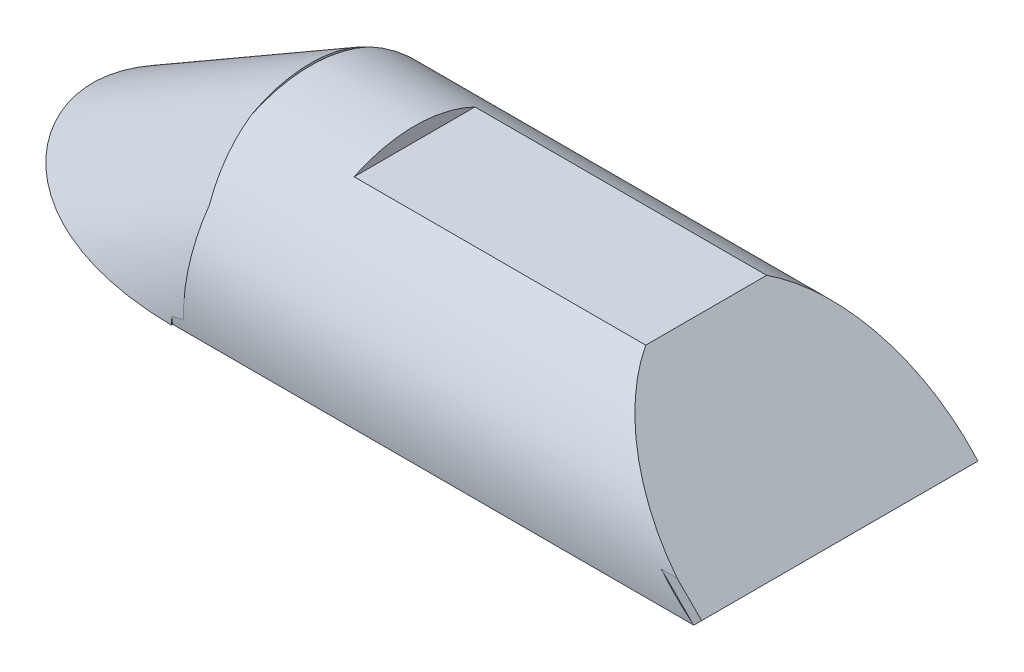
ISO-10303-21;
HEADER;
FILE_DESCRIPTION(('STEP AP214'),'2;1');
FILE_NAME('part.step','',(''),(''),'','','');
FILE_SCHEMA(('AUTOMOTIVE_DESIGN { 1 0 10303 214 1 1 1 1 }'));
ENDSEC;
DATA;
#1=APPLICATION_CONTEXT('core data for automotive mechanical design processes');
#2=APPLICATION_PROTOCOL_DEFINITION('international standard','automotive_design',2000,#1);
#3=PRODUCT_CONTEXT('',#1,'mechanical');
#4=PRODUCT('Part','Part','',(#3));
#5=PRODUCT_RELATED_PRODUCT_CATEGORY('part','',(#4));
#6=PRODUCT_DEFINITION_FORMATION('','',#4);
#7=PRODUCT_DEFINITION_CONTEXT('part definition',#1,'design');
#8=PRODUCT_DEFINITION('design','',#6,#7);
#9=PRODUCT_DEFINITION_SHAPE('','',#8);
#10=(LENGTH_UNIT() NAMED_UNIT(*) SI_UNIT(.MILLI.,.METRE.));
#11=(NAMED_UNIT(*) PLANE_ANGLE_UNIT() SI_UNIT($,.RADIAN.));
#12=(NAMED_UNIT(*) SI_UNIT($,.STERADIAN.) SOLID_ANGLE_UNIT());
#13=UNCERTAINTY_MEASURE_WITH_UNIT(LENGTH_MEASURE(1.E-05),#10,'distance_accuracy_value','');
#14=(GEOMETRIC_REPRESENTATION_CONTEXT(3) GLOBAL_UNCERTAINTY_ASSIGNED_CONTEXT((#13)) GLOBAL_UNIT_ASSIGNED_CONTEXT((#10,
#11,#12)) REPRESENTATION_CONTEXT('',''));
#15=CARTESIAN_POINT('',(0.,0.,0.));
#16=DIRECTION('',(0.,0.,1.));
#17=DIRECTION('',(1.,0.,0.));
#18=AXIS2_PLACEMENT_3D('',#15,#16,#17);
#19=CARTESIAN_POINT('',(102.697086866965,1.77800000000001,0.));
#20=DIRECTION('',(-1.,0.,0.));
#21=DIRECTION('',(0.,-1.,0.));
#22=AXIS2_PLACEMENT_3D('',#19,#20,#21);
#23=CYLINDRICAL_SURFACE('',#22,12.7);
#24=DIRECTION('',(-1.,0.,0.));
#25=VECTOR('',#24,1.);
#26=CARTESIAN_POINT('',(102.697086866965,13.2097724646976,-5.53214048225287));
#27=LINE('',#26,#25);
#28=CARTESIAN_POINT('',(36.2235974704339,13.2097724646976,-5.53214048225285));
#29=VERTEX_POINT('',#28);
#30=CARTESIAN_POINT('',(9.53447934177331,13.2097724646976,-5.53214048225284));
#31=VERTEX_POINT('',#30);
#32=EDGE_CURVE('E139',#29,#31,#27,.T.);
#33=ORIENTED_EDGE('',*,*,#32,.F.);
#34=CARTESIAN_POINT('',(47.6553699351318,1.77800000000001,0.));
#35=DIRECTION('',(0.707106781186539,0.707106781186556,0.));
#36=DIRECTION('',(-0.707106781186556,0.707106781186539,0.));
#37=AXIS2_PLACEMENT_3D('',#34,#35,#36);
#38=ELLIPSE('',#37,17.9605122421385,12.7);
#39=CARTESIAN_POINT('',(48.4191965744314,1.01417336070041,-12.6770094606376));
#40=VERTEX_POINT('',#39);
#41=EDGE_CURVE('E254',#29,#40,#38,.F.);
#42=ORIENTED_EDGE('',*,*,#41,.T.);
#43=CARTESIAN_POINT('',(49.183023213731,1.77800000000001,0.));
#44=DIRECTION('',(-0.707106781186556,0.707106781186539,0.));
#45=DIRECTION('',(-0.707106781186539,-0.707106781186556,0.));
#46=AXIS2_PLACEMENT_3D('',#43,#44,#45);
#47=ELLIPSE('',#46,17.9605122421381,12.7);
#48=CARTESIAN_POINT('',(47.7007760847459,0.295752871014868,-12.6132051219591));
#49=VERTEX_POINT('',#48);
#50=EDGE_CURVE('E159',#49,#40,#47,.F.);
#51=ORIENTED_EDGE('',*,*,#50,.F.);
#52=DIRECTION('',(1.,0.,0.));
#53=VECTOR('',#52,1.);
#54=CARTESIAN_POINT('',(38.6485434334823,0.295752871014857,-12.6132051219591));
#55=LINE('',#54,#53);
#56=CARTESIAN_POINT('',(0.,0.29575287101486,-12.6132051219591));
#57=VERTEX_POINT('',#56);
#58=EDGE_CURVE('E223',#49,#57,#55,.F.);
#59=ORIENTED_EDGE('',*,*,#58,.T.);
#60=CARTESIAN_POINT('',(0.,1.77800000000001,0.));
#61=DIRECTION('',(1.,0.,0.));
#62=DIRECTION('',(0.,0.,-1.));
#63=AXIS2_PLACEMENT_3D('',#60,#61,#62);
#64=CIRCLE('',#63,12.7);
#65=CARTESIAN_POINT('',(0.,0.952827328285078,-12.6731641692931));
#66=VERTEX_POINT('',#65);
#67=EDGE_CURVE('E145',#57,#66,#64,.T.);
#68=ORIENTED_EDGE('',*,*,#67,.T.);
#69=CARTESIAN_POINT('',(3.07958633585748,1.77800000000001,0.));
#70=DIRECTION('',(0.25881904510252,-0.965925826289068,0.));
#71=DIRECTION('',(-0.965925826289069,-0.25881904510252,0.));
#72=AXIS2_PLACEMENT_3D('',#69,#70,#71);
#73=ELLIPSE('',#72,49.0690319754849,12.7);
#74=CARTESIAN_POINT('',(1.09708686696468,1.2467908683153,-12.6888855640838));
#75=VERTEX_POINT('',#74);
#76=EDGE_CURVE('E164',#66,#75,#73,.T.);
#77=ORIENTED_EDGE('',*,*,#76,.T.);
#78=CARTESIAN_POINT('',(1.09708686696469,1.778,0.));
#79=DIRECTION('',(1.,0.,0.));
#80=DIRECTION('',(0.,1.,0.));
#81=AXIS2_PLACEMENT_3D('',#78,#79,#80);
#82=CIRCLE('',#81,12.7);
#83=CARTESIAN_POINT('',(1.09708686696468,9.176788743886,-10.3222054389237));
#84=VERTEX_POINT('',#83);
#85=EDGE_CURVE('E229',#75,#84,#82,.T.);
#86=ORIENTED_EDGE('',*,*,#85,.T.);
#87=CARTESIAN_POINT('',(3.07958633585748,1.77800000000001,0.));
#88=DIRECTION('',(-0.965925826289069,-0.25881904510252,0.));
#89=DIRECTION('',(0.25881904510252,-0.965925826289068,0.));
#90=AXIS2_PLACEMENT_3D('',#87,#88,#89);
#91=ELLIPSE('',#90,13.1480074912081,12.7);
#92=CARTESIAN_POINT('',(0.,13.2711726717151,-5.40342316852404));
#93=VERTEX_POINT('',#92);
#94=EDGE_CURVE('E165',#84,#93,#91,.F.);
#95=ORIENTED_EDGE('',*,*,#94,.T.);
#96=CARTESIAN_POINT('',(0.,13.2711726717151,5.40342316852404));
#97=VERTEX_POINT('',#96);
#98=EDGE_CURVE('E57',#93,#97,#64,.T.);
#99=ORIENTED_EDGE('',*,*,#98,.T.);
#100=CARTESIAN_POINT('',(1.09708686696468,9.17678874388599,10.3222054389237));
#101=VERTEX_POINT('',#100);
#102=EDGE_CURVE('E162',#97,#101,#91,.F.);
#103=ORIENTED_EDGE('',*,*,#102,.T.);
#104=CARTESIAN_POINT('',(1.09708686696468,1.24679086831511,12.6888855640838));
#105=VERTEX_POINT('',#104);
#106=EDGE_CURVE('E231',#101,#105,#82,.T.);
#107=ORIENTED_EDGE('',*,*,#106,.T.);
#108=CARTESIAN_POINT('',(0.,0.952827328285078,12.6731641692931));
#109=VERTEX_POINT('',#108);
#110=EDGE_CURVE('E167',#105,#109,#73,.T.);
#111=ORIENTED_EDGE('',*,*,#110,.T.);
#112=CARTESIAN_POINT('',(0.,0.295752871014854,12.6132051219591));
#113=VERTEX_POINT('',#112);
#114=EDGE_CURVE('E157',#109,#113,#64,.T.);
#115=ORIENTED_EDGE('',*,*,#114,.T.);
#116=DIRECTION('',(1.,0.,0.));
#117=VECTOR('',#116,1.);
#118=CARTESIAN_POINT('',(38.6485434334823,0.295752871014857,12.6132051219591));
#119=LINE('',#118,#117);
#120=CARTESIAN_POINT('',(47.7007760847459,0.295752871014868,12.6132051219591));
#121=VERTEX_POINT('',#120);
#122=EDGE_CURVE('E222',#113,#121,#119,.T.);
#123=ORIENTED_EDGE('',*,*,#122,.T.);
#124=CARTESIAN_POINT('',(46.2185289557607,1.77800000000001,0.));
#125=DIRECTION('',(-0.707106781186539,-0.707106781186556,0.));
#126=DIRECTION('',(-0.707106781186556,0.707106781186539,0.));
#127=AXIS2_PLACEMENT_3D('',#124,#125,#126);
#128=ELLIPSE('',#127,17.9605122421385,12.7);
#129=CARTESIAN_POINT('',(44.7362818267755,3.26024712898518,12.6132051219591));
#130=VERTEX_POINT('',#129);
#131=EDGE_CURVE('E186',#121,#130,#128,.T.);
#132=ORIENTED_EDGE('',*,*,#131,.T.);
#133=DIRECTION('',(-1.,0.,0.));
#134=VECTOR('',#133,1.);
#135=CARTESIAN_POINT('',(48.4191965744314,3.26024712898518,12.6132051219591));
#136=LINE('',#135,#134);
#137=CARTESIAN_POINT('',(46.1731228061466,3.26024712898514,12.6132051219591));
#138=VERTEX_POINT('',#137);
#139=EDGE_CURVE('E156',#138,#130,#136,.T.);
#140=ORIENTED_EDGE('',*,*,#139,.F.);
#141=CARTESIAN_POINT('',(36.2235974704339,13.2097724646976,5.53214048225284));
#142=VERTEX_POINT('',#141);
#143=EDGE_CURVE('E152',#138,#142,#38,.F.);
#144=ORIENTED_EDGE('',*,*,#143,.T.);
#145=DIRECTION('',(-1.,0.,0.));
#146=VECTOR('',#145,1.);
#147=CARTESIAN_POINT('',(102.697086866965,13.2097724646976,5.53214048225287));
#148=LINE('',#147,#146);
#149=CARTESIAN_POINT('',(9.54235371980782,13.2097724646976,5.53214048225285));
#150=VERTEX_POINT('',#149);
#151=EDGE_CURVE('E49',#150,#142,#148,.F.);
#152=ORIENTED_EDGE('',*,*,#151,.F.);
#153=CARTESIAN_POINT('',(9.53841653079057,1.778,0.));
#154=DIRECTION('',(0.999999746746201,0.,-0.000711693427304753));
#155=DIRECTION('',(-0.000711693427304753,-1.71909369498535E-13,-0.999999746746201));
#156=AXIS2_PLACEMENT_3D('',#153,#154,#155);
#157=ELLIPSE('',#156,12.7000032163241,12.7);
#158=EDGE_CURVE('E12',#31,#150,#157,.T.);
#159=ORIENTED_EDGE('',*,*,#158,.F.);
#160=EDGE_LOOP('',(#33,#42,#51,#59,#68,#77,#86,#95,#99,#103,#107,#111,#115,#123,#132,#140,#144,
#152,#159));
#161=FACE_BOUND('',#160,.T.);
#162=ADVANCED_FACE('F33',(#161),#23,.T.);
#163=CARTESIAN_POINT('',(48.4191965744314,1.01417336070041,-12.7));
#164=DIRECTION('',(0.707106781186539,0.707106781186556,0.));
#165=DIRECTION('',(-0.707106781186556,0.707106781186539,0.));
#166=AXIS2_PLACEMENT_3D('',#163,#164,#165);
#167=PLANE('',#166);
#168=ORIENTED_EDGE('',*,*,#41,.F.);
#169=DIRECTION('',(0.,0.,1.));
#170=VECTOR('',#169,1.);
#171=CARTESIAN_POINT('',(36.2235974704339,13.2097724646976,-12.7));
#172=LINE('',#171,#170);
#173=EDGE_CURVE('E42',#29,#142,#172,.T.);
#174=ORIENTED_EDGE('',*,*,#173,.T.);
#175=ORIENTED_EDGE('',*,*,#143,.F.);
#176=DIRECTION('',(0.707106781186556,-0.707106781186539,0.));
#177=VECTOR('',#176,1.);
#178=CARTESIAN_POINT('',(48.4191965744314,1.01417336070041,12.6132051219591));
#179=LINE('',#178,#177);
#180=CARTESIAN_POINT('',(48.4191965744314,1.01417336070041,12.6132051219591));
#181=VERTEX_POINT('',#180);
#182=EDGE_CURVE('E179',#138,#181,#179,.T.);
#183=ORIENTED_EDGE('',*,*,#182,.T.);
#184=DIRECTION('',(0.,0.,-1.));
#185=VECTOR('',#184,1.);
#186=CARTESIAN_POINT('',(48.4191965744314,1.01417336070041,12.6132051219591));
#187=LINE('',#186,#185);
#188=EDGE_CURVE('E176',#181,#40,#187,.T.);
#189=ORIENTED_EDGE('',*,*,#188,.T.);
#190=EDGE_LOOP('',(#168,#174,#175,#183,#189));
#191=FACE_BOUND('',#190,.T.);
#192=ADVANCED_FACE('F298',(#191),#167,.T.);
#193=CARTESIAN_POINT('',(42.9770329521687,24.8128015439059,0.));
#194=DIRECTION('',(-0.86602540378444,-0.499999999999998,0.));
#195=DIRECTION('',(0.499999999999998,-0.86602540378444,0.));
#196=AXIS2_PLACEMENT_3D('',#193,#194,#195);
#197=CYLINDRICAL_SURFACE('',#196,12.7);
#198=ORIENTED_EDGE('',*,*,#94,.F.);
#199=CARTESIAN_POINT('',(1.09708686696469,0.63340339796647,0.));
#200=DIRECTION('',(1.,0.,0.));
#201=DIRECTION('',(0.,-1.,0.));
#202=AXIS2_PLACEMENT_3D('',#199,#200,#201);
#203=ELLIPSE('',#202,14.6646968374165,12.7);
#204=EDGE_CURVE('E234',#84,#75,#203,.F.);
#205=ORIENTED_EDGE('',*,*,#204,.T.);
#206=ORIENTED_EDGE('',*,*,#76,.F.);
#207=CARTESIAN_POINT('',(0.,0.,0.));
#208=DIRECTION('',(1.,0.,0.));
#209=DIRECTION('',(0.,-1.,0.));
#210=AXIS2_PLACEMENT_3D('',#207,#208,#209);
#211=ELLIPSE('',#210,14.6646968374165,12.7);
#212=CARTESIAN_POINT('',(0.,0.254729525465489,-12.6980838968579));
#213=VERTEX_POINT('',#212);
#214=EDGE_CURVE('E168',#66,#213,#211,.F.);
#215=ORIENTED_EDGE('',*,*,#214,.T.);
#216=CARTESIAN_POINT('',(2.0488046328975,0.265849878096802,12.67514476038));
#217=CARTESIAN_POINT('',(1.78330650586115,0.261925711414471,12.6832470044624));
#218=CARTESIAN_POINT('',(1.5177391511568,0.258933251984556,12.6894190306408));
#219=CARTESIAN_POINT('',(0.986518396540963,0.254890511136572,12.6977532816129));
#220=CARTESIAN_POINT('',(0.720864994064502,0.253840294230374,12.6999153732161));
#221=CARTESIAN_POINT('',(-0.0763067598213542,0.253721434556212,12.7001621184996));
#222=CARTESIAN_POINT('',(-0.607849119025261,0.257687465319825,12.6920013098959));
#223=CARTESIAN_POINT('',(-1.67468857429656,0.274431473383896,12.6574225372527));
#224=CARTESIAN_POINT('',(-2.20997966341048,0.287283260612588,12.6308516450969));
#225=CARTESIAN_POINT('',(-3.27882513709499,0.322547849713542,12.5574499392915));
#226=CARTESIAN_POINT('',(-3.81237971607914,0.344959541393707,12.5106214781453));
#227=CARTESIAN_POINT('',(-4.88841182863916,0.400605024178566,12.3931792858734));
#228=CARTESIAN_POINT('',(-5.43082312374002,0.434068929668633,12.3220585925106));
#229=CARTESIAN_POINT('',(-6.51086699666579,0.512281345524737,12.1534465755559));
#230=CARTESIAN_POINT('',(-7.04849876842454,0.557031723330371,12.0559508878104));
#231=CARTESIAN_POINT('',(-8.11460301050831,0.658068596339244,11.831629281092));
#232=CARTESIAN_POINT('',(-8.64310090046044,0.714314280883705,11.7049069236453));
#233=CARTESIAN_POINT('',(-9.68945040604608,0.838540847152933,11.4181775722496));
#234=CARTESIAN_POINT('',(-10.2073072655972,0.906515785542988,11.2581874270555));
#235=CARTESIAN_POINT('',(-11.0805090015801,1.03249092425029,10.9524302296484));
#236=CARTESIAN_POINT('',(-11.4395159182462,1.08768535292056,10.8159449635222));
#237=CARTESIAN_POINT('',(-12.1482468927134,1.20344419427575,10.5224036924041));
#238=CARTESIAN_POINT('',(-12.4979697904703,1.26400927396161,10.3653451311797));
#239=CARTESIAN_POINT('',(-13.1846167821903,1.38968158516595,10.029674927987));
#240=CARTESIAN_POINT('',(-13.5215802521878,1.45477271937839,9.85113817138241));
#241=CARTESIAN_POINT('',(-14.18128399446,1.58877320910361,9.47065184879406));
#242=CARTESIAN_POINT('',(-14.5040246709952,1.6576824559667,9.26870294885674));
#243=CARTESIAN_POINT('',(-15.1362740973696,1.79897249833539,8.83743119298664));
#244=CARTESIAN_POINT('',(-15.4455589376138,1.87138657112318,8.60778932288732));
#245=CARTESIAN_POINT('',(-16.0428488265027,2.01715030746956,8.12242386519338));
#246=CARTESIAN_POINT('',(-16.3308523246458,2.09050003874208,7.866698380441));
#247=CARTESIAN_POINT('',(-16.8814166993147,2.23595382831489,7.32926441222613));
#248=CARTESIAN_POINT('',(-17.1440005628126,2.30805896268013,7.04757986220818));
#249=CARTESIAN_POINT('',(-17.6399342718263,2.44862717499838,6.45873707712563));
#250=CARTESIAN_POINT('',(-17.8732948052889,2.51709157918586,6.15158822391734));
#251=CARTESIAN_POINT('',(-18.2505115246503,2.63073977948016,5.59642186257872));
#252=CARTESIAN_POINT('',(-18.401871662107,2.6773514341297,5.35376819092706));
#253=CARTESIAN_POINT('',(-18.6849189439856,2.76602006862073,4.85647201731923));
#254=CARTESIAN_POINT('',(-18.8166101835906,2.80807799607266,4.60183202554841));
#255=CARTESIAN_POINT('',(-19.0589285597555,2.88657385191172,4.08193463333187));
#256=CARTESIAN_POINT('',(-19.1695599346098,2.92301291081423,3.81667938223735));
#257=CARTESIAN_POINT('',(-19.3685933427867,2.989309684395,3.27713011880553));
#258=CARTESIAN_POINT('',(-19.4569946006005,3.01916716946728,3.00283579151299));
#259=CARTESIAN_POINT('',(-19.6108437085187,3.0715581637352,2.44613494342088));
#260=CARTESIAN_POINT('',(-19.676209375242,3.09406542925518,2.16370318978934));
#261=CARTESIAN_POINT('',(-19.7828023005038,3.13095835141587,1.5937883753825));
#262=CARTESIAN_POINT('',(-19.824029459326,3.14534397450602,1.30630529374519));
#263=CARTESIAN_POINT('',(-19.8818646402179,3.16556660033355,0.728603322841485));
#264=CARTESIAN_POINT('',(-19.8984753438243,3.1714045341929,0.438384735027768));
#265=CARTESIAN_POINT('',(-19.9068913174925,3.17435923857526,-0.142448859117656));
#266=CARTESIAN_POINT('',(-19.8986977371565,3.17147641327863,-0.433063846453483));
#267=CARTESIAN_POINT('',(-19.8588494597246,3.15751450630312,-0.994799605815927));
#268=CARTESIAN_POINT('',(-19.8286425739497,3.14694129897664,-1.26603706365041));
#269=CARTESIAN_POINT('',(-19.7467343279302,3.11845509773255,-1.80484159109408));
#270=CARTESIAN_POINT('',(-19.6950340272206,3.10054246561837,-2.07240884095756));
#271=CARTESIAN_POINT('',(-19.5706727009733,3.0578430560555,-2.60201861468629));
#272=CARTESIAN_POINT('',(-19.4980145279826,3.03305721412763,-2.86406188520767));
#273=CARTESIAN_POINT('',(-19.332462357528,2.97723482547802,-3.38098649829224));
#274=CARTESIAN_POINT('',(-19.2395678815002,2.94619813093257,-3.63586767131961));
#275=CARTESIAN_POINT('',(-19.0331015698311,2.87818333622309,-4.14027605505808));
#276=CARTESIAN_POINT('',(-18.9192728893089,2.84113219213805,-4.38968812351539));
#277=CARTESIAN_POINT('',(-18.6728981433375,2.76227387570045,-4.87828478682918));
#278=CARTESIAN_POINT('',(-18.5403521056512,2.72046671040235,-5.11746939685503));
#279=CARTESIAN_POINT('',(-18.2577929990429,2.63303858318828,-5.58453604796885));
#280=CARTESIAN_POINT('',(-18.1077800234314,2.58741764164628,-5.8124181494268));
#281=CARTESIAN_POINT('',(-17.7915844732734,2.49330452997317,-6.25614276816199));
#282=CARTESIAN_POINT('',(-17.6253960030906,2.44481131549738,-6.47198085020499));
#283=CARTESIAN_POINT('',(-17.2610500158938,2.34099485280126,-6.91178577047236));
#284=CARTESIAN_POINT('',(-17.0613566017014,2.28547135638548,-7.13443391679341));
#285=CARTESIAN_POINT('',(-16.6460280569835,2.17326129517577,-7.56406786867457));
#286=CARTESIAN_POINT('',(-16.4303866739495,2.11657428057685,-7.7710474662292));
#287=CARTESIAN_POINT('',(-15.7623211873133,1.94640637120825,-8.36825086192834));
#288=CARTESIAN_POINT('',(-15.2885936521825,1.83277145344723,-8.73493157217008));
#289=CARTESIAN_POINT('',(-14.3932435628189,1.63313204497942,-9.34306924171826));
#290=CARTESIAN_POINT('',(-13.9788543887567,1.54598385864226,-9.59507801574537));
#291=CARTESIAN_POINT('',(-13.1281401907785,1.37833606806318,-10.0619704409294));
#292=CARTESIAN_POINT('',(-12.6918038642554,1.29783994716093,-10.2768347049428));
#293=CARTESIAN_POINT('',(-11.8014503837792,1.14495554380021,-10.6728346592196));
#294=CARTESIAN_POINT('',(-11.3473892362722,1.0725894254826,-10.8538789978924));
#295=CARTESIAN_POINT('',(-10.4268347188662,0.937086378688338,-11.1848409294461));
#296=CARTESIAN_POINT('',(-9.96034211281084,0.873948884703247,-11.3347604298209));
#297=CARTESIAN_POINT('',(-9.09551545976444,0.766828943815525,-11.5843287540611));
#298=CARTESIAN_POINT('',(-8.69855787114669,0.721403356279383,-11.6881898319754));
#299=CARTESIAN_POINT('',(-7.89966089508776,0.637238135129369,-11.8781121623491));
#300=CARTESIAN_POINT('',(-7.49772076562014,0.59849951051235,-11.9641707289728));
#301=CARTESIAN_POINT('',(-6.68988141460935,0.527579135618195,-12.1200775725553));
#302=CARTESIAN_POINT('',(-6.28397972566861,0.4954017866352,-12.1899149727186));
#303=CARTESIAN_POINT('',(-5.46947833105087,0.43743507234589,-12.3147022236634));
#304=CARTESIAN_POINT('',(-5.06087874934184,0.411645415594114,-12.3696527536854));
#305=CARTESIAN_POINT('',(-4.24157927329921,0.366186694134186,-12.4659257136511));
#306=CARTESIAN_POINT('',(-3.83087856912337,0.346520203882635,-12.5072424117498));
#307=CARTESIAN_POINT('',(-3.00814065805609,0.313032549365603,-12.5773010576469));
#308=CARTESIAN_POINT('',(-2.59610332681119,0.299211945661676,-12.606041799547));
#309=CARTESIAN_POINT('',(-1.77147153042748,0.277120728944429,-12.6518681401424));
#310=CARTESIAN_POINT('',(-1.35887749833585,0.268847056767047,-12.6689601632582));
#311=CARTESIAN_POINT('',(-0.533310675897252,0.257529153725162,-12.6923201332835));
#312=CARTESIAN_POINT('',(-0.120337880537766,0.254484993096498,-12.6985879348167));
#313=CARTESIAN_POINT('',(0.585733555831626,0.253489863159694,-12.7006378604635));
#314=CARTESIAN_POINT('',(0.878827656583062,0.254316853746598,-12.6989358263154));
#315=CARTESIAN_POINT('',(1.46424562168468,0.258340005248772,-12.6906418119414));
#316=CARTESIAN_POINT('',(1.7565696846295,0.261530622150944,-12.6840612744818));
#317=CARTESIAN_POINT('',(2.0488046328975,0.265849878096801,-12.67514476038));
#318=B_SPLINE_CURVE_WITH_KNOTS('',3,(#216,#217,#218,#219,#220,#221,#222,#223,#224,#225,#226,
#227,#228,#229,#230,#231,#232,#233,#234,#235,#236,#237,#238,#239,#240,#241,#242,#243,#244,#245,
#246,#247,#248,#249,#250,#251,#252,#253,#254,#255,#256,#257,#258,#259,#260,#261,#262,#263,#264,
#265,#266,#267,#268,#269,#270,#271,#272,#273,#274,#275,#276,#277,#278,#279,#280,#281,#282,#283,
#284,#285,#286,#287,#288,#289,#290,#291,#292,#293,#294,#295,#296,#297,#298,#299,#300,#301,#302,
#303,#304,#305,#306,#307,#308,#309,#310,#311,#312,#313,#314,#315,#316,#317),.UNSPECIFIED.,.F.,
.F.,(4,2,2,2,2,2,2,2,2,2,2,2,2,2,2,2,2,2,2,2,2,2,2,2,2,2,2,2,2,2,2,2,2,2,2,2,2,2,2,2,2,2,2,2,2,
2,2,2,2,2,4),(0.,0.796934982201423,1.59389643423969,3.18838200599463,4.79627391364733,
6.40397914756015,8.04752420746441,9.6913413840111,11.3294210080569,12.9666730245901,
14.1301377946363,15.2937472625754,16.4534112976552,17.6130423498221,18.7876063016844,
19.962255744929,21.1358328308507,22.3089794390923,23.177402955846,24.0456454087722,
24.913712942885,25.7818107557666,26.6529750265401,27.5241428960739,28.3952158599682,
29.2662484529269,30.0846397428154,30.9029906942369,31.7212303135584,32.5394892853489,
33.3685533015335,34.1976160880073,35.0266744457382,35.8560361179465,36.7676962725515,
37.6797157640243,39.5029939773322,40.9793969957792,42.4565682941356,43.9376736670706,
45.41868824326,46.6566825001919,47.8948633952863,49.1338721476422,50.3728243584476,
51.6122967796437,52.8518880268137,54.0907950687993,55.3297187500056,56.2089715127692,
57.0861684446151),.UNSPECIFIED.);
#319=CARTESIAN_POINT('',(0.,0.254729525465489,12.6980838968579));
#320=VERTEX_POINT('',#319);
#321=EDGE_CURVE('E216',#320,#213,#318,.T.);
#322=ORIENTED_EDGE('',*,*,#321,.F.);
#323=EDGE_CURVE('E171',#320,#109,#211,.F.);
#324=ORIENTED_EDGE('',*,*,#323,.T.);
#325=ORIENTED_EDGE('',*,*,#110,.F.);
#326=EDGE_CURVE('E237',#105,#101,#203,.F.);
#327=ORIENTED_EDGE('',*,*,#326,.T.);
#328=ORIENTED_EDGE('',*,*,#102,.F.);
#329=EDGE_CURVE('E172',#97,#93,#211,.F.);
#330=ORIENTED_EDGE('',*,*,#329,.T.);
#331=EDGE_LOOP('',(#198,#205,#206,#215,#322,#324,#325,#327,#328,#330));
#332=FACE_BOUND('',#331,.T.);
#333=ADVANCED_FACE('F35',(#332),#197,.T.);
#334=CARTESIAN_POINT('',(-25.4000000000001,-25.9097416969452,0.));
#335=DIRECTION('',(1.,0.,0.));
#336=DIRECTION('',(0.,1.,0.));
#337=AXIS2_PLACEMENT_3D('',#334,#335,#336);
#338=CYLINDRICAL_SURFACE('',#337,29.083);
#339=CARTESIAN_POINT('',(0.,-25.9097416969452,0.));
#340=DIRECTION('',(1.,0.,0.));
#341=DIRECTION('',(0.,0.,-1.));
#342=AXIS2_PLACEMENT_3D('',#339,#340,#341);
#343=CIRCLE('',#342,29.083);
#344=EDGE_CURVE('E257',#320,#113,#343,.F.);
#345=ORIENTED_EDGE('',*,*,#344,.F.);
#346=ORIENTED_EDGE('',*,*,#321,.T.);
#347=EDGE_CURVE('E256',#57,#213,#343,.F.);
#348=ORIENTED_EDGE('',*,*,#347,.F.);
#349=ORIENTED_EDGE('',*,*,#58,.F.);
#350=CARTESIAN_POINT('',(73.9062706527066,-25.9097416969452,0.));
#351=DIRECTION('',(-0.707106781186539,-0.707106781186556,0.));
#352=DIRECTION('',(0.707106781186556,-0.707106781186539,0.));
#353=AXIS2_PLACEMENT_3D('',#350,#351,#352);
#354=ELLIPSE('',#353,41.1295730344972,29.083);
#355=CARTESIAN_POINT('',(46.4264869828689,1.57004197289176,-9.52272956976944));
#356=VERTEX_POINT('',#355);
#357=EDGE_CURVE('E250',#49,#356,#354,.F.);
#358=ORIENTED_EDGE('',*,*,#357,.T.);
#359=DIRECTION('',(1.,0.,0.));
#360=VECTOR('',#359,1.);
#361=CARTESIAN_POINT('',(38.6485434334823,1.57004197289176,-9.52272956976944));
#362=LINE('',#361,#360);
#363=CARTESIAN_POINT('',(1.09708686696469,1.57004197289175,-9.52272956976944));
#364=VERTEX_POINT('',#363);
#365=EDGE_CURVE('E244',#364,#356,#362,.T.);
#366=ORIENTED_EDGE('',*,*,#365,.F.);
#367=CARTESIAN_POINT('',(1.0970868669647,-25.9097416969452,0.));
#368=DIRECTION('',(1.,0.,0.));
#369=DIRECTION('',(0.,1.,0.));
#370=AXIS2_PLACEMENT_3D('',#367,#368,#369);
#371=CIRCLE('',#370,29.083);
#372=CARTESIAN_POINT('',(1.09708686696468,1.58151977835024,-9.48954327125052));
#373=VERTEX_POINT('',#372);
#374=EDGE_CURVE('E199',#364,#373,#371,.T.);
#375=ORIENTED_EDGE('',*,*,#374,.T.);
#376=CARTESIAN_POINT('',(4.20350958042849,1.57906295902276,9.49665770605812));
#377=CARTESIAN_POINT('',(3.80452901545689,1.57385459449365,9.51170518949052));
#378=CARTESIAN_POINT('',(3.40527534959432,1.57066941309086,9.52091147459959));
#379=CARTESIAN_POINT('',(2.60656842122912,1.56859139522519,9.52692283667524));
#380=CARTESIAN_POINT('',(2.20711513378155,1.56969962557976,9.523724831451));
#381=CARTESIAN_POINT('',(1.40657615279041,1.57647398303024,9.50415224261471));
#382=CARTESIAN_POINT('',(1.00549217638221,1.58216266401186,9.48771245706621));
#383=CARTESIAN_POINT('',(0.204273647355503,1.59836819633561,9.44062577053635));
#384=CARTESIAN_POINT('',(-0.195860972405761,1.60888469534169,9.40997990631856));
#385=CARTESIAN_POINT('',(-0.999843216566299,1.63514523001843,9.33283358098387));
#386=CARTESIAN_POINT('',(-1.40366909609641,1.65095717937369,9.28612692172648));
#387=CARTESIAN_POINT('',(-2.20878002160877,1.68797308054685,9.17553495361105));
#388=CARTESIAN_POINT('',(-2.61006481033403,1.7091775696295,9.11164793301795));
#389=CARTESIAN_POINT('',(-3.40805091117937,1.75707122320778,8.96517071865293));
#390=CARTESIAN_POINT('',(-3.80475993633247,1.78374904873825,8.88261915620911));
#391=CARTESIAN_POINT('',(-4.59281702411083,1.84266140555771,8.69681232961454));
#392=CARTESIAN_POINT('',(-4.98416664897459,1.87489427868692,8.59356324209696));
#393=CARTESIAN_POINT('',(-5.67448117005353,1.93714971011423,8.3892937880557));
#394=CARTESIAN_POINT('',(-5.97486972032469,1.96610452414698,8.2927584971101));
#395=CARTESIAN_POINT('',(-6.57005015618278,2.0272159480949,8.08449648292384));
#396=CARTESIAN_POINT('',(-6.86484183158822,2.05937267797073,7.97276919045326));
#397=CARTESIAN_POINT('',(-7.44698652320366,2.12661583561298,7.73298365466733));
#398=CARTESIAN_POINT('',(-7.73434795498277,2.16169873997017,7.60494495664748));
#399=CARTESIAN_POINT('',(-8.30017277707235,2.23446160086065,7.33108381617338));
#400=CARTESIAN_POINT('',(-8.57863628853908,2.27214152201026,7.18526161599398));
#401=CARTESIAN_POINT('',(-9.12778571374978,2.3500376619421,6.87255775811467));
#402=CARTESIAN_POINT('',(-9.39833401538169,2.39027935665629,6.70543934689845));
#403=CARTESIAN_POINT('',(-9.92522072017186,2.47209877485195,6.3502157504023));
#404=CARTESIAN_POINT('',(-10.1815571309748,2.51367668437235,6.16210763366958));
#405=CARTESIAN_POINT('',(-10.6760536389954,2.5970278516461,5.76421864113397));
#406=CARTESIAN_POINT('',(-10.914247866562,2.63880057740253,5.55448030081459));
#407=CARTESIAN_POINT('',(-11.3688753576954,2.72126003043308,5.1124453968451));
#408=CARTESIAN_POINT('',(-11.5853209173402,2.76194736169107,4.88016172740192));
#409=CARTESIAN_POINT('',(-11.9225411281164,2.82717904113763,4.47623508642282));
#410=CARTESIAN_POINT('',(-12.0507768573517,2.85249827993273,4.31091288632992));
#411=CARTESIAN_POINT('',(-12.2943850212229,2.90141748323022,3.97083001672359));
#412=CARTESIAN_POINT('',(-12.4097611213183,2.92501793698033,3.79607205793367));
#413=CARTESIAN_POINT('',(-12.6261922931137,2.96994103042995,3.43764752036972));
#414=CARTESIAN_POINT('',(-12.7272502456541,2.99126412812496,3.25398274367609));
#415=CARTESIAN_POINT('',(-12.9136336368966,3.03107236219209,2.87850683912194));
#416=CARTESIAN_POINT('',(-12.998958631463,3.04955741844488,2.68669548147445));
#417=CARTESIAN_POINT('',(-13.1531064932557,3.08327562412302,2.29452703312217));
#418=CARTESIAN_POINT('',(-13.2217968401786,3.09848255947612,2.09411538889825));
#419=CARTESIAN_POINT('',(-13.3406013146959,3.12496904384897,1.68758434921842));
#420=CARTESIAN_POINT('',(-13.3907153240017,3.13624856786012,1.48146491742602));
#421=CARTESIAN_POINT('',(-13.4713949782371,3.15448515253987,1.06534150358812));
#422=CARTESIAN_POINT('',(-13.5019703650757,3.16144436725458,0.855339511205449));
#423=CARTESIAN_POINT('',(-13.5429991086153,3.17079622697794,0.433285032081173));
#424=CARTESIAN_POINT('',(-13.5534546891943,3.17318937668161,0.221232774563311));
#425=CARTESIAN_POINT('',(-13.5540100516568,3.17331668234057,-0.178833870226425));
#426=CARTESIAN_POINT('',(-13.5462827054,3.17154815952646,-0.366848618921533));
#427=CARTESIAN_POINT('',(-13.514981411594,3.16440800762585,-0.741485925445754));
#428=CARTESIAN_POINT('',(-13.4914076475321,3.15903642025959,-0.928108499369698));
#429=CARTESIAN_POINT('',(-13.4287879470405,3.1448443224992,-1.29857007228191));
#430=CARTESIAN_POINT('',(-13.3897441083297,3.13602427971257,-1.48240944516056));
#431=CARTESIAN_POINT('',(-13.2967751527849,3.11517865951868,-1.84609544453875));
#432=CARTESIAN_POINT('',(-13.2428495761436,3.103152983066,-2.02594194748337));
#433=CARTESIAN_POINT('',(-13.1216369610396,3.0763765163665,-2.37838137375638));
#434=CARTESIAN_POINT('',(-13.0545211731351,3.06166080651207,-2.55103606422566));
#435=CARTESIAN_POINT('',(-12.9073743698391,3.02975681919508,-2.89057207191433));
#436=CARTESIAN_POINT('',(-12.8273387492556,3.01256766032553,-3.05745130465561));
#437=CARTESIAN_POINT('',(-12.6553248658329,2.97610099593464,-3.38468441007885));
#438=CARTESIAN_POINT('',(-12.5633466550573,2.95682349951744,-3.54503831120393));
#439=CARTESIAN_POINT('',(-12.3684364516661,2.91656695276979,-3.8587352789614));
#440=CARTESIAN_POINT('',(-12.2655020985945,2.89558753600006,-4.01207682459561));
#441=CARTESIAN_POINT('',(-12.0033179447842,2.84301615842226,-4.37567538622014));
#442=CARTESIAN_POINT('',(-11.8388638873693,2.81073501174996,-4.58210252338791));
#443=CARTESIAN_POINT('',(-11.492473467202,2.7445292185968,-4.97937701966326));
#444=CARTESIAN_POINT('',(-11.3105310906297,2.71060400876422,-5.17021897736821));
#445=CARTESIAN_POINT('',(-10.7418228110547,2.60768560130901,-5.71985711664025));
#446=CARTESIAN_POINT('',(-10.3324629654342,2.53760880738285,-6.05537981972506));
#447=CARTESIAN_POINT('',(-9.5855347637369,2.41853236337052,-6.58657198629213));
#448=CARTESIAN_POINT('',(-9.25737909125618,2.368834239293,-6.79582047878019));
#449=CARTESIAN_POINT('',(-8.58343391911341,2.27248513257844,-7.18492725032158));
#450=CARTESIAN_POINT('',(-8.23763580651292,2.2258356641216,-7.36477099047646));
#451=CARTESIAN_POINT('',(-7.5323438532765,2.1365771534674,-7.6977020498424));
#452=CARTESIAN_POINT('',(-7.17282880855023,2.09397475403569,-7.85074571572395));
#453=CARTESIAN_POINT('',(-6.44373939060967,2.01349150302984,-8.13236595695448));
#454=CARTESIAN_POINT('',(-6.0741615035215,1.97561232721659,-8.26093385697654));
#455=CARTESIAN_POINT('',(-5.38250447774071,1.91012334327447,-8.478614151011));
#456=CARTESIAN_POINT('',(-5.06143000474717,1.88182248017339,-8.57074830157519));
#457=CARTESIAN_POINT('',(-4.41516614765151,1.82899924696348,-8.74019532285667));
#458=CARTESIAN_POINT('',(-4.08997753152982,1.8044761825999,-8.81751091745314));
#459=CARTESIAN_POINT('',(-3.43617159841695,1.75919717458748,-8.95858269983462));
#460=CARTESIAN_POINT('',(-3.10755187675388,1.73844409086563,-9.02232859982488));
#461=CARTESIAN_POINT('',(-2.4478925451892,1.70067939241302,-9.13723973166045));
#462=CARTESIAN_POINT('',(-2.116852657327,1.6836682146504,-9.18840349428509));
#463=CARTESIAN_POINT('',(-1.12070591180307,1.63811222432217,-9.32448832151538));
#464=CARTESIAN_POINT('',(-0.452913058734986,1.61506833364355,-9.39193164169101));
#465=CARTESIAN_POINT('',(0.885389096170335,1.58271365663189,-9.48620560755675));
#466=CARTESIAN_POINT('',(1.55589699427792,1.57339650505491,-9.51305507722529));
#467=CARTESIAN_POINT('',(2.55663366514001,1.56886915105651,-9.52611110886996));
#468=CARTESIAN_POINT('',(2.88673204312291,1.56889760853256,-9.52603374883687));
#469=CARTESIAN_POINT('',(3.54577664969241,1.57185329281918,-9.51750064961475));
#470=CARTESIAN_POINT('',(3.87472325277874,1.57477145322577,-9.50907111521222));
#471=CARTESIAN_POINT('',(4.20350958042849,1.57906295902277,-9.49665770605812));
#472=B_SPLINE_CURVE_WITH_KNOTS('',3,(#376,#377,#378,#379,#380,#381,#382,#383,#384,#385,#386,
#387,#388,#389,#390,#391,#392,#393,#394,#395,#396,#397,#398,#399,#400,#401,#402,#403,#404,#405,
#406,#407,#408,#409,#410,#411,#412,#413,#414,#415,#416,#417,#418,#419,#420,#421,#422,#423,#424,
#425,#426,#427,#428,#429,#430,#431,#432,#433,#434,#435,#436,#437,#438,#439,#440,#441,#442,#443,
#444,#445,#446,#447,#448,#449,#450,#451,#452,#453,#454,#455,#456,#457,#458,#459,#460,#461,#462,
#463,#464,#465,#466,#467,#468,#469,#470,#471),.UNSPECIFIED.,.F.,.F.,(4,2,2,2,2,2,2,2,2,2,2,2,2,
2,2,2,2,2,2,2,2,2,2,2,2,2,2,2,2,2,2,2,2,2,2,2,2,2,2,2,2,2,2,2,2,2,2,4),(0.,1.19788542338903,
2.39606851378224,3.60018773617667,4.80421909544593,6.02432435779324,7.24455122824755,
8.46227526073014,9.6796364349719,10.6297949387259,11.5799890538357,12.529055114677,
13.4781082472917,14.4388229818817,15.399672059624,16.358666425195,17.3171155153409,
17.9488406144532,18.5803851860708,19.211802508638,19.8432376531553,20.4795488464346,
21.1158640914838,21.7518618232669,22.3877892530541,22.9516386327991,23.5154814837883,
24.0792479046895,24.6430317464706,25.199929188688,25.7570255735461,26.3141195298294,
26.8713337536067,27.6677829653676,28.464507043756,30.0593908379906,31.2350554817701,
32.4112996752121,33.5894423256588,34.7680017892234,35.773298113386,36.7784094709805,
37.7842801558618,38.79026824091,40.8032893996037,42.8153768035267,43.8055703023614,
44.7926668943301),.UNSPECIFIED.);
#473=CARTESIAN_POINT('',(1.09708686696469,1.58151977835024,9.48954327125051));
#474=VERTEX_POINT('',#473);
#475=EDGE_CURVE('E192',#474,#373,#472,.T.);
#476=ORIENTED_EDGE('',*,*,#475,.F.);
#477=CARTESIAN_POINT('',(1.0970868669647,-25.9097416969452,0.));
#478=DIRECTION('',(1.,0.,0.));
#479=DIRECTION('',(0.,1.,0.));
#480=AXIS2_PLACEMENT_3D('',#477,#478,#479);
#481=CIRCLE('',#480,29.083);
#482=CARTESIAN_POINT('',(1.09708686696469,1.57004197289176,9.52272956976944));
#483=VERTEX_POINT('',#482);
#484=EDGE_CURVE('E189',#474,#483,#481,.T.);
#485=ORIENTED_EDGE('',*,*,#484,.T.);
#486=DIRECTION('',(1.,0.,0.));
#487=VECTOR('',#486,1.);
#488=CARTESIAN_POINT('',(38.6485434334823,1.57004197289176,9.52272956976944));
#489=LINE('',#488,#487);
#490=CARTESIAN_POINT('',(46.4264869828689,1.57004197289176,9.52272956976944));
#491=VERTEX_POINT('',#490);
#492=EDGE_CURVE('E240',#491,#483,#489,.F.);
#493=ORIENTED_EDGE('',*,*,#492,.F.);
#494=EDGE_CURVE('E247',#491,#121,#354,.F.);
#495=ORIENTED_EDGE('',*,*,#494,.T.);
#496=ORIENTED_EDGE('',*,*,#122,.F.);
#497=EDGE_LOOP('',(#345,#346,#348,#349,#358,#366,#375,#476,#485,#493,#495,#496));
#498=FACE_BOUND('',#497,.T.);
#499=ADVANCED_FACE('F204',(#498),#338,.F.);
#500=CARTESIAN_POINT('',(29.9792722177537,18.0172567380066,-15.2290963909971));
#501=DIRECTION('',(-0.707106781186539,-0.707106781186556,0.));
#502=DIRECTION('',(0.707106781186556,-0.707106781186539,0.));
#503=AXIS2_PLACEMENT_3D('',#500,#501,#502);
#504=PLANE('',#503);
#505=DIRECTION('',(0.707106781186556,-0.707106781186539,0.));
#506=VECTOR('',#505,1.);
#507=CARTESIAN_POINT('',(29.9792722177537,18.0172567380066,12.6132051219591));
#508=LINE('',#507,#506);
#509=EDGE_CURVE('E251',#130,#121,#508,.T.);
#510=ORIENTED_EDGE('',*,*,#509,.F.);
#511=ORIENTED_EDGE('',*,*,#131,.F.);
#512=EDGE_LOOP('',(#510,#511));
#513=FACE_BOUND('',#512,.T.);
#514=ADVANCED_FACE('F209',(#513),#504,.F.);
#515=CARTESIAN_POINT('',(52.5020329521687,30.312062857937,0.));
#516=DIRECTION('',(-0.86602540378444,-0.499999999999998,0.));
#517=DIRECTION('',(0.499999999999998,-0.86602540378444,0.));
#518=AXIS2_PLACEMENT_3D('',#515,#516,#517);
#519=CYLINDRICAL_SURFACE('',#518,9.525);
#520=CARTESIAN_POINT('',(1.09708686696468,0.633403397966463,0.));
#521=DIRECTION('',(1.,0.,0.));
#522=DIRECTION('',(0.,-1.,0.));
#523=AXIS2_PLACEMENT_3D('',#520,#521,#522);
#524=ELLIPSE('',#523,10.9985226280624,9.525);
#525=CARTESIAN_POINT('',(1.09708686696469,9.17678874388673,5.99862902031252));
#526=VERTEX_POINT('',#525);
#527=EDGE_CURVE('E238',#474,#526,#524,.F.);
#528=ORIENTED_EDGE('',*,*,#527,.F.);
#529=ORIENTED_EDGE('',*,*,#475,.T.);
#530=CARTESIAN_POINT('',(1.09708686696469,9.17678874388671,-5.9986290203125));
#531=VERTEX_POINT('',#530);
#532=EDGE_CURVE('E242',#531,#373,#524,.F.);
#533=ORIENTED_EDGE('',*,*,#532,.F.);
#534=EDGE_CURVE('E241',#526,#531,#524,.F.);
#535=ORIENTED_EDGE('',*,*,#534,.F.);
#536=EDGE_LOOP('',(#528,#529,#533,#535));
#537=FACE_BOUND('',#536,.T.);
#538=ADVANCED_FACE('F201',(#537),#519,.F.);
#539=CARTESIAN_POINT('',(1.09708686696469,1.778,0.));
#540=DIRECTION('',(1.,0.,0.));
#541=DIRECTION('',(0.,1.,0.));
#542=AXIS2_PLACEMENT_3D('',#539,#540,#541);
#543=PLANE('',#542);
#544=ORIENTED_EDGE('',*,*,#534,.T.);
#545=CARTESIAN_POINT('',(1.09708686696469,1.778,0.));
#546=DIRECTION('',(1.,0.,0.));
#547=DIRECTION('',(0.,1.,0.));
#548=AXIS2_PLACEMENT_3D('',#545,#546,#547);
#549=CIRCLE('',#548,9.525);
#550=EDGE_CURVE('E225',#531,#526,#549,.T.);
#551=ORIENTED_EDGE('',*,*,#550,.T.);
#552=EDGE_LOOP('',(#544,#551));
#553=FACE_BOUND('',#552,.T.);
#554=ADVANCED_FACE('F289',(#553),#543,.F.);
#555=ORIENTED_EDGE('',*,*,#326,.F.);
#556=ORIENTED_EDGE('',*,*,#106,.F.);
#557=EDGE_LOOP('',(#555,#556));
#558=FACE_BOUND('',#557,.T.);
#559=ADVANCED_FACE('F286',(#558),#543,.F.);
#560=ORIENTED_EDGE('',*,*,#204,.F.);
#561=ORIENTED_EDGE('',*,*,#85,.F.);
#562=EDGE_LOOP('',(#560,#561));
#563=FACE_BOUND('',#562,.T.);
#564=ADVANCED_FACE('F288',(#563),#543,.F.);
#565=CARTESIAN_POINT('',(1.09708686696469,1.778,0.));
#566=DIRECTION('',(1.,0.,0.));
#567=DIRECTION('',(0.,1.,0.));
#568=AXIS2_PLACEMENT_3D('',#565,#566,#567);
#569=PLANE('',#568);
#570=ORIENTED_EDGE('',*,*,#484,.F.);
#571=ORIENTED_EDGE('',*,*,#527,.T.);
#572=EDGE_CURVE('E226',#526,#483,#549,.T.);
#573=ORIENTED_EDGE('',*,*,#572,.T.);
#574=EDGE_LOOP('',(#570,#571,#573));
#575=FACE_BOUND('',#574,.T.);
#576=ADVANCED_FACE('F212',(#575),#569,.T.);
#577=ORIENTED_EDGE('',*,*,#374,.F.);
#578=EDGE_CURVE('E230',#364,#531,#549,.T.);
#579=ORIENTED_EDGE('',*,*,#578,.T.);
#580=ORIENTED_EDGE('',*,*,#532,.T.);
#581=EDGE_LOOP('',(#577,#579,#580));
#582=FACE_BOUND('',#581,.T.);
#583=ADVANCED_FACE('F341',(#582),#569,.T.);
#584=CARTESIAN_POINT('',(1.09708686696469,1.778,0.));
#585=DIRECTION('',(1.,0.,0.));
#586=DIRECTION('',(0.,1.,0.));
#587=AXIS2_PLACEMENT_3D('',#584,#585,#586);
#588=CYLINDRICAL_SURFACE('',#587,9.525);
#589=ORIENTED_EDGE('',*,*,#365,.T.);
#590=CARTESIAN_POINT('',(46.2185289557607,1.77800000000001,0.));
#591=DIRECTION('',(-0.707106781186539,-0.707106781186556,0.));
#592=DIRECTION('',(0.707106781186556,-0.707106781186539,0.));
#593=AXIS2_PLACEMENT_3D('',#590,#591,#592);
#594=ELLIPSE('',#593,13.4703841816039,9.525);
#595=EDGE_CURVE('E184',#356,#491,#594,.F.);
#596=ORIENTED_EDGE('',*,*,#595,.T.);
#597=ORIENTED_EDGE('',*,*,#492,.T.);
#598=ORIENTED_EDGE('',*,*,#572,.F.);
#599=ORIENTED_EDGE('',*,*,#550,.F.);
#600=ORIENTED_EDGE('',*,*,#578,.F.);
#601=EDGE_LOOP('',(#589,#596,#597,#598,#599,#600));
#602=FACE_BOUND('',#601,.T.);
#603=ADVANCED_FACE('F319',(#602),#588,.F.);
#604=CARTESIAN_POINT('',(47.7007760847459,0.295752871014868,-12.7));
#605=DIRECTION('',(0.707106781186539,0.707106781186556,0.));
#606=DIRECTION('',(-0.707106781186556,0.707106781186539,0.));
#607=AXIS2_PLACEMENT_3D('',#604,#605,#606);
#608=PLANE('',#607);
#609=DIRECTION('',(0.,0.,-1.));
#610=VECTOR('',#609,1.);
#611=CARTESIAN_POINT('',(47.7007760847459,0.295752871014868,12.6132051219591));
#612=LINE('',#611,#610);
#613=EDGE_CURVE('E173',#121,#49,#612,.T.);
#614=ORIENTED_EDGE('',*,*,#613,.F.);
#615=ORIENTED_EDGE('',*,*,#494,.F.);
#616=ORIENTED_EDGE('',*,*,#595,.F.);
#617=ORIENTED_EDGE('',*,*,#357,.F.);
#618=EDGE_LOOP('',(#614,#615,#616,#617));
#619=FACE_BOUND('',#618,.T.);
#620=ADVANCED_FACE('F308',(#619),#608,.F.);
#621=CARTESIAN_POINT('',(48.4191965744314,1.01417336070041,12.6132051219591));
#622=DIRECTION('',(-0.707106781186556,0.707106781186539,0.));
#623=DIRECTION('',(-0.707106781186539,-0.707106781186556,0.));
#624=AXIS2_PLACEMENT_3D('',#621,#622,#623);
#625=PLANE('',#624);
#626=ORIENTED_EDGE('',*,*,#613,.T.);
#627=ORIENTED_EDGE('',*,*,#50,.T.);
#628=ORIENTED_EDGE('',*,*,#188,.F.);
#629=DIRECTION('',(-0.707106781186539,-0.707106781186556,0.));
#630=VECTOR('',#629,1.);
#631=CARTESIAN_POINT('',(48.4191965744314,1.01417336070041,12.6132051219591));
#632=LINE('',#631,#630);
#633=EDGE_CURVE('E181',#181,#121,#632,.T.);
#634=ORIENTED_EDGE('',*,*,#633,.T.);
#635=EDGE_LOOP('',(#626,#627,#628,#634));
#636=FACE_BOUND('',#635,.T.);
#637=ADVANCED_FACE('F312',(#636),#625,.F.);
#638=CARTESIAN_POINT('',(48.4191965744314,1.01417336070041,12.6132051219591));
#639=DIRECTION('',(0.,0.,-1.));
#640=DIRECTION('',(-1.,0.,0.));
#641=AXIS2_PLACEMENT_3D('',#638,#639,#640);
#642=PLANE('',#641);
#643=ORIENTED_EDGE('',*,*,#182,.F.);
#644=ORIENTED_EDGE('',*,*,#139,.T.);
#645=ORIENTED_EDGE('',*,*,#509,.T.);
#646=ORIENTED_EDGE('',*,*,#633,.F.);
#647=EDGE_LOOP('',(#643,#644,#645,#646));
#648=FACE_BOUND('',#647,.T.);
#649=ADVANCED_FACE('F310',(#648),#642,.F.);
#650=CARTESIAN_POINT('',(0.,2.18805011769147,-0.00199842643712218));
#651=DIRECTION('',(1.,0.,0.));
#652=DIRECTION('',(0.,0.,-1.));
#653=AXIS2_PLACEMENT_3D('',#650,#651,#652);
#654=PLANE('',#653);
#655=ORIENTED_EDGE('',*,*,#67,.F.);
#656=ORIENTED_EDGE('',*,*,#347,.T.);
#657=ORIENTED_EDGE('',*,*,#214,.F.);
#658=EDGE_LOOP('',(#655,#656,#657));
#659=FACE_BOUND('',#658,.T.);
#660=ADVANCED_FACE('F273',(#659),#654,.T.);
#661=ORIENTED_EDGE('',*,*,#344,.T.);
#662=ORIENTED_EDGE('',*,*,#114,.F.);
#663=ORIENTED_EDGE('',*,*,#323,.F.);
#664=EDGE_LOOP('',(#661,#662,#663));
#665=FACE_BOUND('',#664,.T.);
#666=ADVANCED_FACE('F263',(#665),#654,.T.);
#667=ORIENTED_EDGE('',*,*,#98,.F.);
#668=ORIENTED_EDGE('',*,*,#329,.F.);
#669=EDGE_LOOP('',(#667,#668));
#670=FACE_BOUND('',#669,.T.);
#671=ADVANCED_FACE('F283',(#670),#654,.T.);
#672=CARTESIAN_POINT('',(9.54373377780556,13.2097724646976,7.47125864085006));
#673=DIRECTION('',(0.999999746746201,0.,-0.000711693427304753));
#674=DIRECTION('',(-0.000711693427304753,0.,-0.999999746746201));
#675=AXIS2_PLACEMENT_3D('',#672,#673,#674);
#676=PLANE('',#675);
#677=ORIENTED_EDGE('',*,*,#158,.T.);
#678=DIRECTION('',(0.000711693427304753,0.,0.999999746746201));
#679=VECTOR('',#678,1.);
#680=CARTESIAN_POINT('',(9.54373377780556,13.2097724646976,7.47125864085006));
#681=LINE('',#680,#679);
#682=EDGE_CURVE('E142',#31,#150,#681,.T.);
#683=ORIENTED_EDGE('',*,*,#682,.F.);
#684=EDGE_LOOP('',(#677,#683));
#685=FACE_BOUND('',#684,.T.);
#686=ADVANCED_FACE('F148',(#685),#676,.T.);
#687=CARTESIAN_POINT('',(9.54373377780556,13.2097724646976,7.47125864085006));
#688=DIRECTION('',(0.,1.,0.));
#689=DIRECTION('',(0.,0.,1.));
#690=AXIS2_PLACEMENT_3D('',#687,#688,#689);
#691=PLANE('',#690);
#692=ORIENTED_EDGE('',*,*,#32,.T.);
#693=ORIENTED_EDGE('',*,*,#682,.T.);
#694=ORIENTED_EDGE('',*,*,#151,.T.);
#695=ORIENTED_EDGE('',*,*,#173,.F.);
#696=EDGE_LOOP('',(#692,#693,#694,#695));
#697=FACE_BOUND('',#696,.T.);
#698=ADVANCED_FACE('F141',(#697),#691,.T.);
#699=CLOSED_SHELL('',(#162,#192,#333,#499,#514,#538,#554,#559,#564,#576,#583,#603,#620,#637,
#649,#660,#666,#671,#686,#698));
#700=MANIFOLD_SOLID_BREP('B2',#699);
#701=ADVANCED_BREP_SHAPE_REPRESENTATION('',(#18,#700),#14);
#702=SHAPE_DEFINITION_REPRESENTATION(#9,#701);
ENDSEC;
END-ISO-10303-21;
